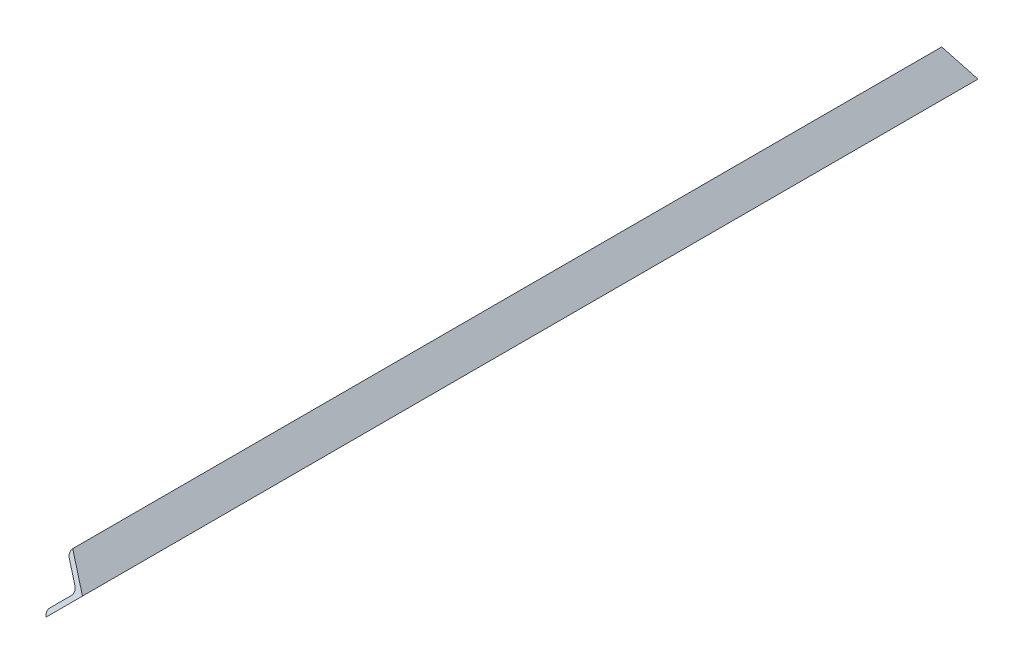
from build123d import *

# Parameters (mm, degrees)
EXTRUDE_1_DEPTH      = 850
EXTRUDE_1_DEPTH_BACK = 850
CUT_EXTRUDE_2_REACH  = 856.317


with BuildPart() as part:
    # Sketch 2 → Extrude 1 (new, two sides: drawn at the far end of the back side and taken through both)
    with BuildSketch(Plane.XY.offset(-EXTRUDE_1_DEPTH_BACK)):
        with BuildLine():
            Line((-29.77501925, 0), (-72.201426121, -42.426406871))
            ThreePointArc((-72.201426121, -42.426406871), (-74.544571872, -36.769552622), (-72.201426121, -31.112698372))
            Line((-72.201426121, -31.112698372), (-46.745581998, -5.656854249))
            ThreePointArc((-46.745581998, -5.656854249), (-44.402436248, 0), (-46.745581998, 5.656854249))
            Line((-46.745581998, 5.656854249), (-72.201426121, 31.112698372))
            ThreePointArc((-72.201426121, 31.112698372), (-74.544571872, 36.769552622), (-72.201426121, 42.426406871))
            Line((-72.201426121, 42.426406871), (-29.77501925, 0))
        make_face()
    extrude(amount=EXTRUDE_1_DEPTH + EXTRUDE_1_DEPTH_BACK)

    # Sketch 4 → Cut-Extrude 2 (cut, up to next)
    with BuildSketch(Plane(origin=(0, 0, 0), x_dir=(0, 0, -1), z_dir=(1, 0, 0)), mode=Mode.PRIVATE) as cut_extrude_2_sk1:
        Polygon((-850, -42.426406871), (-850, 120.375536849), (-756.006253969, 120.375536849), align=None)
    cut_extrude_2_tool1 = extrude(cut_extrude_2_sk1.sketch, amount=-CUT_EXTRUDE_2_REACH, mode=Mode.PRIVATE) & part.part
    # Sketch 4 → Cut-Extrude 2 (cut, up to next)
    with BuildSketch(Plane(origin=(0, 0, 0), x_dir=(0, 0, -1), z_dir=(1, 0, 0)), mode=Mode.PRIVATE) as cut_extrude_2_sk2:
        Polygon((850, -42.426406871), (774.828373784, 87.774669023), (850, 87.774669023), align=None)
    cut_extrude_2_tool2 = extrude(cut_extrude_2_sk2.sketch, amount=-CUT_EXTRUDE_2_REACH, mode=Mode.PRIVATE) & part.part
    add(cut_extrude_2_tool1.solids().sort_by_distance((0, 66.108222, 818.668751))[0], mode=Mode.SUBTRACT)
    add(cut_extrude_2_tool2.solids().sort_by_distance((0, 44.37431, -824.942791))[0], mode=Mode.SUBTRACT)


solid = part.part
